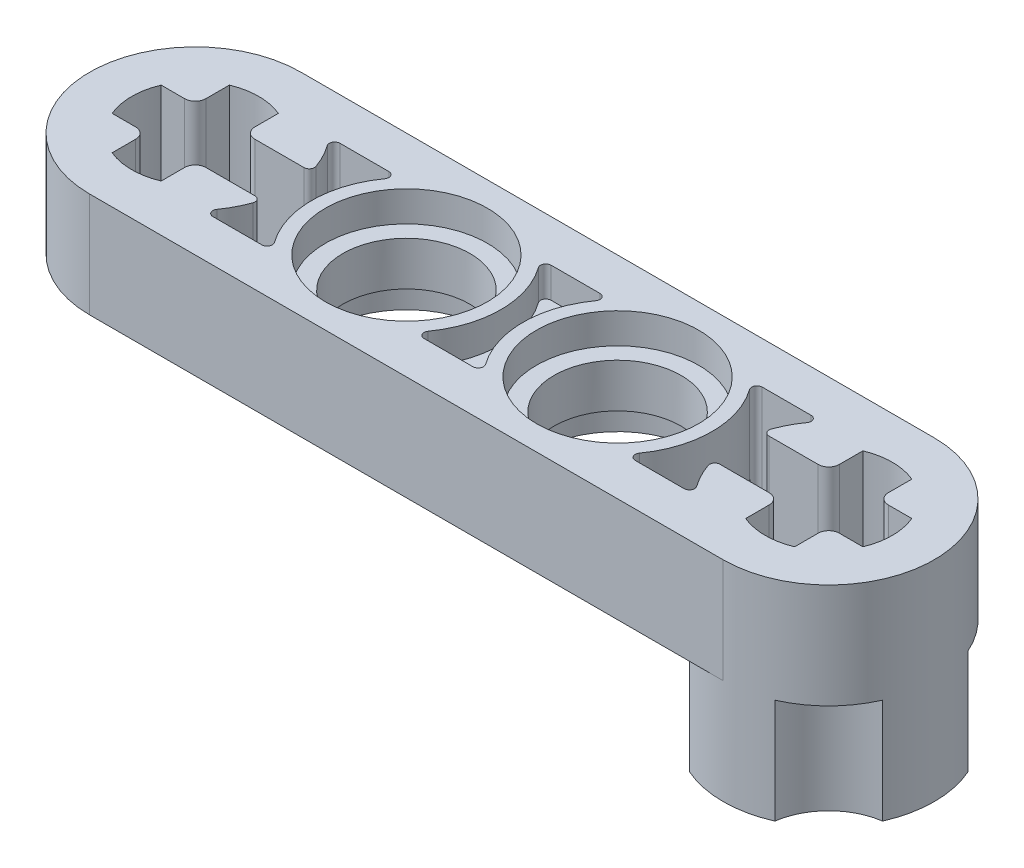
from build123d import *
from build123d.topology import SkipClean

# Parameters (mm, degrees)
BASE_EXTRUDE_DEPTH   = 1.9685
SKETCH2_R            = 2.3876
CUT_EXTRUDE1_DEPTH   = 17.830524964
SKETCH3_R            = 3.048
CUT_EXTRUDE2_DEPTH   = 1.143
CUT_EXTRUDE3_START   = -1.143
SKETCH4_R            = 3.048
CUT_EXTRUDE3_DEPTH   = 1.143
LPATTERN1_COUNT      = 2
LPATTERN1_PITCH      = 7.9375
CUT_EXTRUDE4_DEPTH   = 17.830524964
FILLET1_R            = 0.396875
CUT_EXTRUDE5_DEPTH   = 17.830524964
FILLET2_R            = 0.1984375
FILLET1_OF_MIRROR1_R = 0.396875
FILLET2_OF_MIRROR1_R = 0.1984375
CUT_EXTRUDE6_DEPTH   = 1.143
FILLET3_R            = 0.1984375
FILLET3_OF_MIRROR2_R = 0.1984375
SKETCH8_R            = 3.96875
SKETCH8_R_2          = 2.3876
BOSS_EXTRUDE1_DEPTH  = 3.937
CUT_EXTRUDE7_START   = -3.937
SKETCH9_R            = 2.3876
CUT_EXTRUDE7_DEPTH   = 3.937
CIRPATTERN1_COUNT    = 4


with BuildPart() as part:
    # Sketch1 → Base-Extrude (new, symmetric)
    with BuildSketch(Plane(origin=(0, 0, 0), x_dir=(1, 0, 0), z_dir=(0, 1, 0))):
        with BuildLine():
            Line((-11.90625, 3.96875), (11.90625, 3.96875))
            ThreePointArc((11.90625, 3.96875), (15.875, 0), (11.90625, -3.96875))
            Line((11.90625, -3.96875), (-11.90625, -3.96875))
            ThreePointArc((-11.90625, -3.96875), (-15.875, 0), (-11.90625, 3.96875))
        make_face()
    extrude(amount=BASE_EXTRUDE_DEPTH, both=True)

    # Sketch2 → Cut-Extrude1 (cut, through all)
    with BuildSketch(Plane(origin=(0, 1.9685, 0), x_dir=(-1, 0, 0), z_dir=(0, 1, 0))):
        with Locations(Location((3.96875, 0, 0), (0, 0, 90))):
            Circle(SKETCH2_R)
    cut_extrude1 = extrude(amount=-CUT_EXTRUDE1_DEPTH, mode=Mode.SUBTRACT)

    # Sketch3 → Cut-Extrude2 (cut)
    with BuildSketch(Plane(origin=(0, 1.9685, 0), x_dir=(-1, 0, 0), z_dir=(0, 1, 0))):
        with Locations(Location((3.96875, 0, 0), (0, 0, 90))):
            Circle(SKETCH3_R)
    cut_extrude2 = extrude(amount=-CUT_EXTRUDE2_DEPTH, mode=Mode.SUBTRACT)

    # Sketch4 → Cut-Extrude3 (cut)
    with BuildSketch(Plane.XZ.offset(1.9685).offset(CUT_EXTRUDE3_START)):
        with Locations(Location((-3.96875, 0, 0), (0, 0, 90))):
            Circle(SKETCH4_R)
    cut_extrude3 = extrude(amount=CUT_EXTRUDE3_DEPTH, mode=Mode.SUBTRACT)

    # LPattern1: Cut-Extrude1, Cut-Extrude2, Cut-Extrude3 ×2
    with Locations(*[(i * LPATTERN1_PITCH, 0, 0) for i in range(1, LPATTERN1_COUNT)]):
        add(cut_extrude1, mode=Mode.SUBTRACT)
        add(cut_extrude2, mode=Mode.SUBTRACT)
        add(cut_extrude3, mode=Mode.SUBTRACT)

    # Sketch5 → Cut-Extrude4 (cut, through all)
    with BuildSketch(Plane(origin=(0, 1.9685, 0), x_dir=(-1, 0, 0), z_dir=(0, 1, 0))):
        with BuildLine():
            Line((10.9855, -2.202919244), (10.9855, -0.92075))
            Line((10.9855, -0.92075), (9.703330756, -0.92075))
            ThreePointArc((9.703330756, -0.92075), (9.51865, 0), (9.703330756, 0.92075))
            Line((9.703330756, 0.92075), (10.9855, 0.92075))
            Line((10.9855, 0.92075), (10.9855, 2.202919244))
            ThreePointArc((10.9855, 2.202919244), (11.90625, 2.3876), (12.827, 2.202919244))
            Line((12.827, 2.202919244), (12.827, 0.92075))
            Line((12.827, 0.92075), (14.109169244, 0.92075))
            ThreePointArc((14.109169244, 0.92075), (14.29385, 0), (14.109169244, -0.92075))
            Line((14.109169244, -0.92075), (12.827, -0.92075))
            Line((12.827, -0.92075), (12.827, -2.202919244))
            ThreePointArc((12.827, -2.202919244), (11.90625, -2.3876), (10.9855, -2.202919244))
        make_face()
    cut_extrude4 = extrude(amount=-CUT_EXTRUDE4_DEPTH, mode=Mode.SUBTRACT)

    # Fillet1
    fillet1_edges = [part.edges().sort_by_distance(p)[0] for p in [
        (-10.9855, 0, 0.92075),
        (-12.827, 0, 0.92075),
        (-12.827, 0, -0.92075),
        (-10.9855, 0, -0.92075),
    ]]
    fillet(fillet1_edges, radius=FILLET1_R)

    # Sketch6 → Cut-Extrude5 (cut, through all)
    with BuildSketch(Plane(origin=(0, 1.9685, 0), x_dir=(-1, 0, 0), z_dir=(0, 1, 0))):
        with BuildLine():
            Line((9.271007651, -2.3876), (6.603992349, -2.3876))
            ThreePointArc((6.603992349, -2.3876), (7.52475, 0), (6.603992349, 2.3876))
            Line((6.603992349, 2.3876), (9.271007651, 2.3876))
            ThreePointArc((9.271007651, 2.3876), (8.783903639, 1.701789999), (8.471522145, 0.92075))
            Line((8.471522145, 0.92075), (9.703330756, 0.92075))
            ThreePointArc((9.703330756, 0.92075), (9.51865, 0), (9.703330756, -0.92075))
            Line((9.703330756, -0.92075), (8.471522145, -0.92075))
            ThreePointArc((8.471522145, -0.92075), (8.783903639, -1.701789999), (9.271007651, -2.3876))
        make_face()
    cut_extrude5 = extrude(amount=-CUT_EXTRUDE5_DEPTH, mode=Mode.SUBTRACT)

    # Fillet2
    fillet2_edges = [part.edges().sort_by_distance(p)[0] for p in [
        (-8.471522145, 0, -0.92075),
        (-9.271007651, 0, -2.3876),
        (-6.603992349, 0, -2.3876),
        (-6.603992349, 0, 2.3876),
        (-9.271007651, 0, 2.3876),
        (-8.471522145, 0, 0.92075),
    ]]
    fillet(fillet2_edges, radius=FILLET2_R)

    # Mirror1: Cut-Extrude4, Cut-Extrude5 across plane
    add(cut_extrude4.mirror(Plane(origin=(0, 0, 0), x_dir=(0, 0, 1), z_dir=(1, 0, 0))), mode=Mode.SUBTRACT)
    add(cut_extrude5.mirror(Plane(origin=(0, 0, 0), x_dir=(0, 0, 1), z_dir=(1, 0, 0))), mode=Mode.SUBTRACT)

    # Fillet1 of Mirror1
    fillet1_of_mirror1_edges = [part.edges().sort_by_distance(p)[0] for p in [
        (10.9855, 0, 0.92075),
        (12.827, 0, 0.92075),
        (12.827, 0, -0.92075),
        (10.9855, 0, -0.92075),
    ]]
    fillet(fillet1_of_mirror1_edges, radius=FILLET1_OF_MIRROR1_R)

    # Fillet2 of Mirror1
    fillet2_of_mirror1_edges = [part.edges().sort_by_distance(p)[0] for p in [
        (8.471522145, 0, -0.92075),
        (9.271007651, 0, -2.3876),
        (6.603992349, 0, -2.3876),
        (6.603992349, 0, 2.3876),
        (9.271007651, 0, 2.3876),
        (8.471522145, 0, 0.92075),
    ]]
    fillet(fillet2_of_mirror1_edges, radius=FILLET2_OF_MIRROR1_R)

    # Sketch7 → Cut-Extrude6 (cut)
    with BuildSketch(Plane(origin=(7.626637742, 1.9685, -1.750590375), x_dir=(-1, 0, 0), z_dir=(0, 1, 0))):
        with BuildLine():
            Line((8.960145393, -0.637009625), (6.293130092, -0.637009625))
            ThreePointArc((6.293130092, -0.637009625), (7.213887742, 1.750590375), (6.293130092, 4.138190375))
            Line((6.293130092, 4.138190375), (8.960145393, 4.138190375))
            ThreePointArc((8.960145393, 4.138190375), (8.277552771, 3.030085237), (8.039387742, 1.750590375))
            ThreePointArc((8.039387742, 1.750590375), (8.277552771, 0.471095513), (8.960145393, -0.637009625))
        make_face()
    cut_extrude6 = extrude(amount=-CUT_EXTRUDE6_DEPTH, mode=Mode.SUBTRACT)

    # Fillet3
    fillet3_edges = [part.edges().sort_by_distance(p)[0] for p in [
        (-1.333507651, 1.397, -2.3876),
        (1.333507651, 1.397, -2.3876),
        (1.333507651, 1.397, 2.3876),
        (-1.333507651, 1.397, 2.3876),
    ]]
    fillet(fillet3_edges, radius=FILLET3_R)

    # Mirror2: Cut-Extrude6 across plane
    add(cut_extrude6.mirror(Plane.ZX), mode=Mode.SUBTRACT)

    # Fillet3 of Mirror2
    fillet3_of_mirror2_edges = [part.edges().sort_by_distance(p)[0] for p in [
        (-1.333507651, -1.397, -2.3876),
        (1.333507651, -1.397, -2.3876),
        (1.333507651, -1.397, 2.3876),
        (-1.333507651, -1.397, 2.3876),
    ]]
    fillet(fillet3_of_mirror2_edges, radius=FILLET3_OF_MIRROR2_R)

    # Sketch8 → Boss-Extrude1 (add)
    with SkipClean():  # the faces are left unmerged after this step: merging them gives an invalid solid
        with BuildSketch(Plane.XZ.offset(1.9685)):
            with Locations(Location((11.90625, 0, 0), (0, 0, 270))):
                Circle(SKETCH8_R)
            with Locations(Location((11.90625, 0, 0), (0, 0, 67.31662771))):
                Circle(SKETCH8_R_2, mode=Mode.SUBTRACT)
        extrude(amount=BOSS_EXTRUDE1_DEPTH)

    # Sketch9 → Cut-Extrude7 (cut)
    with SkipClean():  # the faces are left unmerged after this step: merging them gives an invalid solid
        with BuildSketch(Plane.XZ.offset(5.9055).offset(CUT_EXTRUDE7_START)):
            with Locations((15.875, -3.96875)):
                Circle(SKETCH9_R)
        cut_extrude7 = extrude(amount=CUT_EXTRUDE7_DEPTH, mode=Mode.SUBTRACT)

    # CirPattern1: Cut-Extrude7 ×4 about axis
    with SkipClean():  # the faces are left unmerged after this step: merging them gives an invalid solid
        cirpattern1_axis = Axis((11.90625, 0, 0), (0, 1, 0))
        for i in range(1, CIRPATTERN1_COUNT):
            add(cut_extrude7.rotate(cirpattern1_axis, i * 360 / CIRPATTERN1_COUNT), mode=Mode.SUBTRACT)


solid = part.part
